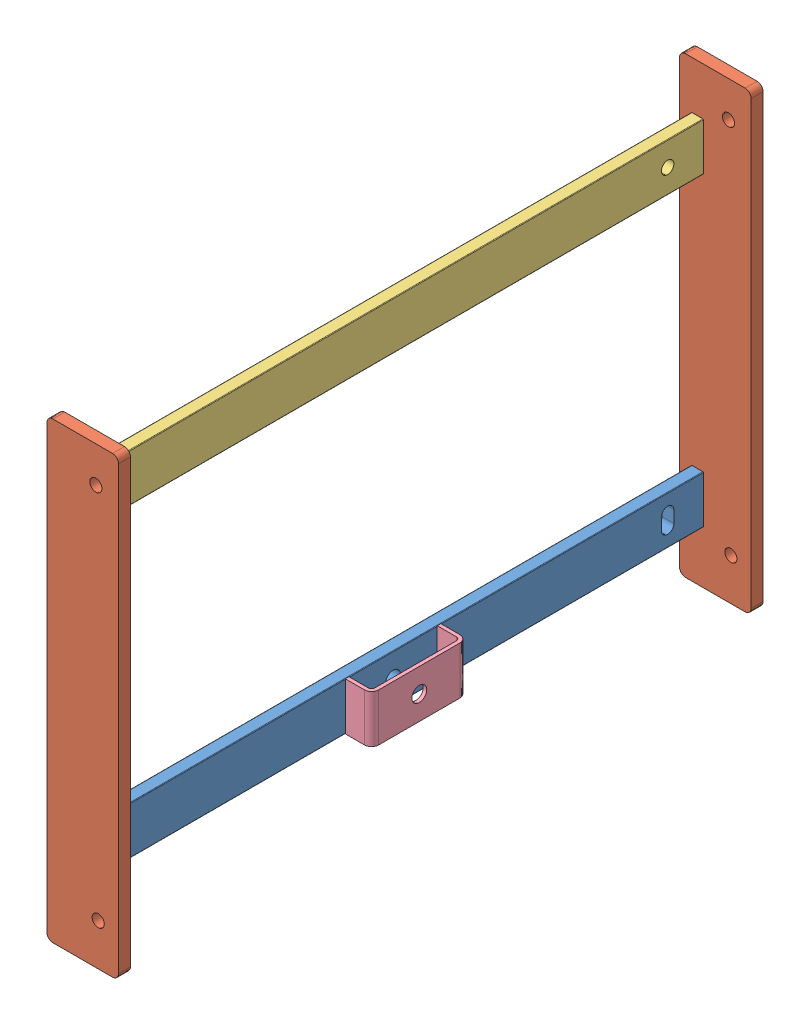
SolidWorks assembly TABLIER ASM.sldasm, configuration Défaut (file format 7000). Lengths in mm.
Overall size (60 380 540).
5 component instances, 4 part files, 13 mates.
Components (placement in the parent):
- PLAT INF TABLIER-1: PLAT INF TABLIER.SLDPRT [Défaut] at (5.9761 -140.737 -2.4788) x (1 0 0) z (0 1 0) size (10 520 40)
- TOLE LATERALE TABLIER-3: TOLE LATERALE TABLIER.SLDPRT [Défaut] at (20.9761 -14.737 262.5212) x (1 0 0) z (0 1 0) size (60 10 380)
- TOLE LATERALE TABLIER-2: TOLE LATERALE TABLIER.SLDPRT [Défaut] at (20.9761 -14.737 -267.4788) x (1 0 0) z (0 1 0) size (60 10 380)
- PLAT SUP TABLIER-1: PLAT SUP TABLIER.SLDPRT [Défaut] at (5.9761 115.263 -2.4788) x (1 0 0) z (0 -1 0) size (10 520 40)
- SUPPORT POULIE TABLIER-1: SUPPORT POULIE TABLIER.SLDPRT [Défaut] at (32.9761 -140.737 -2.4788) x (0 0 -1) z (1 0 0) size (80 40 22)
Mates (geometry in assembly coordinates):
- Coïncidente1: coincident aligned: plane of PLAT INF TABLIER-1 through (10.9761 -120.737 257.5212) normal (0 1 0); plane of SUPPORT POULIE TABLIER-1 through (32.9761 -120.737 37.5212) normal (0 1 0)
- Coaxiale1: concentric anti-aligned: cylinder of PLAT INF TABLIER-1 through (10.9761 -140.737 -2.4788) axis (1 0 0) radius 6.25; cylinder of SUPPORT POULIE TABLIER-1 through (29.9761 -140.737 -2.4788) axis (-1 0 0) radius 6.25
- Coïncidente3: coincident anti-aligned: plane of PLAT INF TABLIER-1 through (10.9761 -140.737 -2.4788) normal (1 0 0); plane of SUPPORT POULIE TABLIER-1 through (10.9761 -140.737 -2.4788) normal (-1 0 0)
- Coïncidente4: coincident anti-aligned: plane of TOLE LATERALE TABLIER-2 through (-4.0239 170.263 -262.4788) normal (0 0 1); plane of PLAT SUP TABLIER-1 through (10.9761 135.263 -262.4788) normal (0 0 -1)
- Coïncidente5: coincident anti-aligned: plane of PLAT INF TABLIER-1 through (10.9761 -120.737 -262.4788) normal (0 0 -1); plane of TOLE LATERALE TABLIER-2 through (-4.0239 170.263 -262.4788) normal (0 0 1)
- Coïncidente6: coincident anti-aligned: plane of TOLE LATERALE TABLIER-3 through (-4.0239 170.263 257.5212) normal (0 0 -1); plane of PLAT SUP TABLIER-1 through (10.9761 95.263 257.5212) normal (0 0 1)
- Coïncidente7: coincident anti-aligned: plane of PLAT INF TABLIER-1 through (10.9761 -160.737 257.5212) normal (0 0 1); plane of TOLE LATERALE TABLIER-3 through (-4.0239 170.263 257.5212) normal (0 0 -1)
- Distance1: distance = 40 mm aligned: plane of TOLE LATERALE TABLIER-3 through (-4.0239 175.263 267.5212) normal (0 1 0); plane of PLAT SUP TABLIER-1 through (10.9761 135.263 257.5212) normal (0 1 0)
- Distance2: distance = 40 mm aligned: plane of PLAT SUP TABLIER-1 through (10.9761 135.263 257.5212) normal (0 1 0); plane of TOLE LATERALE TABLIER-2 through (-4.0239 175.263 -262.4788) normal (0 1 0)
- Distance3: distance = 10 mm aligned: plane of TOLE LATERALE TABLIER-2 through (-9.0239 -199.737 -262.4788) normal (-1 0 0); plane of PLAT SUP TABLIER-1 through (0.9761 115.263 -2.4788) normal (-1 0 0)
- Distance4: distance = 10 mm aligned: plane of PLAT SUP TABLIER-1 through (0.9761 115.263 -2.4788) normal (-1 0 0); plane of TOLE LATERALE TABLIER-3 through (-9.0239 -199.737 267.5212) normal (-1 0 0)
- Distance5: distance = 216 mm anti-aligned: plane of PLAT INF TABLIER-1 through (10.9761 -120.737 257.5212) normal (0 1 0); plane of PLAT SUP TABLIER-1 through (10.9761 95.263 -262.4788) normal (0 -1 0)
- Distance6: distance = 10 mm aligned: plane of PLAT INF TABLIER-1 through (0.9761 -140.737 -2.4788) normal (-1 0 0); plane of TOLE LATERALE TABLIER-2 through (-9.0239 -199.737 -262.4788) normal (-1 0 0)
